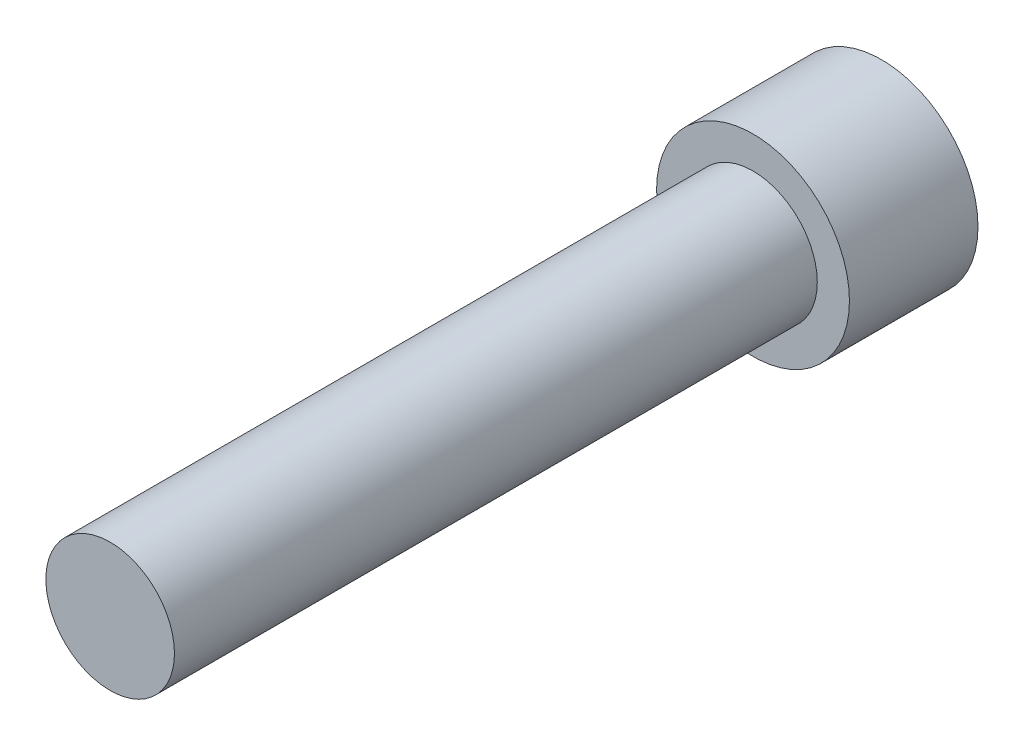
ISO-10303-21;
HEADER;
FILE_DESCRIPTION(('STEP AP214'),'2;1');
FILE_NAME('part.step','',(''),(''),'','','');
FILE_SCHEMA(('AUTOMOTIVE_DESIGN { 1 0 10303 214 1 1 1 1 }'));
ENDSEC;
DATA;
#1=APPLICATION_CONTEXT('core data for automotive mechanical design processes');
#2=APPLICATION_PROTOCOL_DEFINITION('international standard','automotive_design',2000,#1);
#3=PRODUCT_CONTEXT('',#1,'mechanical');
#4=PRODUCT('Part','Part','',(#3));
#5=PRODUCT_RELATED_PRODUCT_CATEGORY('part','',(#4));
#6=PRODUCT_DEFINITION_FORMATION('','',#4);
#7=PRODUCT_DEFINITION_CONTEXT('part definition',#1,'design');
#8=PRODUCT_DEFINITION('design','',#6,#7);
#9=PRODUCT_DEFINITION_SHAPE('','',#8);
#10=(LENGTH_UNIT() NAMED_UNIT(*) SI_UNIT(.MILLI.,.METRE.));
#11=(NAMED_UNIT(*) PLANE_ANGLE_UNIT() SI_UNIT($,.RADIAN.));
#12=(NAMED_UNIT(*) SI_UNIT($,.STERADIAN.) SOLID_ANGLE_UNIT());
#13=UNCERTAINTY_MEASURE_WITH_UNIT(LENGTH_MEASURE(1.E-05),#10,'distance_accuracy_value','');
#14=(GEOMETRIC_REPRESENTATION_CONTEXT(3) GLOBAL_UNCERTAINTY_ASSIGNED_CONTEXT((#13)) GLOBAL_UNIT_ASSIGNED_CONTEXT((#10,
#11,#12)) REPRESENTATION_CONTEXT('',''));
#15=CARTESIAN_POINT('',(0.,0.,0.));
#16=DIRECTION('',(0.,0.,1.));
#17=DIRECTION('',(1.,0.,0.));
#18=AXIS2_PLACEMENT_3D('',#15,#16,#17);
#19=CARTESIAN_POINT('',(0.,-4.7625,-6.35));
#20=DIRECTION('',(0.,0.,-1.));
#21=DIRECTION('',(-1.,0.,0.));
#22=AXIS2_PLACEMENT_3D('',#19,#20,#21);
#23=PLANE('',#22);
#24=DIRECTION('',(0.866025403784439,-0.5,0.));
#25=VECTOR('',#24,1.);
#26=CARTESIAN_POINT('',(0.,2.7569630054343,-6.35));
#27=LINE('',#26,#25);
#28=CARTESIAN_POINT('',(0.,2.7569630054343,-6.35));
#29=VERTEX_POINT('',#28);
#30=CARTESIAN_POINT('',(2.3876,1.37848150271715,-6.35));
#31=VERTEX_POINT('',#30);
#32=EDGE_CURVE('E51',#29,#31,#27,.T.);
#33=ORIENTED_EDGE('',*,*,#32,.F.);
#34=DIRECTION('',(0.866025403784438,0.5,0.));
#35=VECTOR('',#34,1.);
#36=CARTESIAN_POINT('',(-2.3876,1.37848150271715,-6.35));
#37=LINE('',#36,#35);
#38=CARTESIAN_POINT('',(-2.3876,1.37848150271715,-6.35));
#39=VERTEX_POINT('',#38);
#40=EDGE_CURVE('E134',#39,#29,#37,.T.);
#41=ORIENTED_EDGE('',*,*,#40,.F.);
#42=DIRECTION('',(0.,1.,0.));
#43=VECTOR('',#42,1.);
#44=CARTESIAN_POINT('',(-2.3876,-1.37848150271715,-6.35));
#45=LINE('',#44,#43);
#46=CARTESIAN_POINT('',(-2.3876,-1.37848150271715,-6.35));
#47=VERTEX_POINT('',#46);
#48=EDGE_CURVE('E132',#47,#39,#45,.T.);
#49=ORIENTED_EDGE('',*,*,#48,.F.);
#50=DIRECTION('',(-0.866025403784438,0.5,0.));
#51=VECTOR('',#50,1.);
#52=CARTESIAN_POINT('',(0.,-2.7569630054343,-6.35));
#53=LINE('',#52,#51);
#54=CARTESIAN_POINT('',(0.,-2.7569630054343,-6.35));
#55=VERTEX_POINT('',#54);
#56=EDGE_CURVE('E99',#55,#47,#53,.T.);
#57=ORIENTED_EDGE('',*,*,#56,.F.);
#58=DIRECTION('',(-0.866025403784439,-0.5,0.));
#59=VECTOR('',#58,1.);
#60=CARTESIAN_POINT('',(2.3876,-1.37848150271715,-6.35));
#61=LINE('',#60,#59);
#62=CARTESIAN_POINT('',(2.3876,-1.37848150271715,-6.35));
#63=VERTEX_POINT('',#62);
#64=EDGE_CURVE('E128',#63,#55,#61,.T.);
#65=ORIENTED_EDGE('',*,*,#64,.F.);
#66=DIRECTION('',(0.,-1.,0.));
#67=VECTOR('',#66,1.);
#68=CARTESIAN_POINT('',(2.3876,1.37848150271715,-6.35));
#69=LINE('',#68,#67);
#70=EDGE_CURVE('E125',#31,#63,#69,.T.);
#71=ORIENTED_EDGE('',*,*,#70,.F.);
#72=EDGE_LOOP('',(#33,#41,#49,#57,#65,#71));
#73=FACE_BOUND('',#72,.T.);
#74=CARTESIAN_POINT('',(0.,0.,-6.35));
#75=DIRECTION('',(0.,0.,1.));
#76=DIRECTION('',(1.,0.,0.));
#77=AXIS2_PLACEMENT_3D('',#74,#75,#76);
#78=CIRCLE('',#77,4.7625);
#79=CARTESIAN_POINT('',(4.7625,0.,-6.35));
#80=VERTEX_POINT('',#79);
#81=EDGE_CURVE('E11',#80,#80,#78,.T.);
#82=ORIENTED_EDGE('',*,*,#81,.F.);
#83=EDGE_LOOP('',(#82));
#84=FACE_BOUND('',#83,.T.);
#85=ADVANCED_FACE('F37',(#73,#84),#23,.T.);
#86=CARTESIAN_POINT('',(0.,0.,31.75));
#87=DIRECTION('',(0.,0.,1.));
#88=DIRECTION('',(1.,0.,0.));
#89=AXIS2_PLACEMENT_3D('',#86,#87,#88);
#90=CYLINDRICAL_SURFACE('',#89,4.7625);
#91=ORIENTED_EDGE('',*,*,#81,.T.);
#92=EDGE_LOOP('',(#91));
#93=FACE_BOUND('',#92,.T.);
#94=CARTESIAN_POINT('',(0.,0.,0.));
#95=DIRECTION('',(0.,0.,1.));
#96=DIRECTION('',(1.,0.,0.));
#97=AXIS2_PLACEMENT_3D('',#94,#95,#96);
#98=CIRCLE('',#97,4.7625);
#99=CARTESIAN_POINT('',(4.7625,0.,0.));
#100=VERTEX_POINT('',#99);
#101=EDGE_CURVE('E44',#100,#100,#98,.T.);
#102=ORIENTED_EDGE('',*,*,#101,.F.);
#103=EDGE_LOOP('',(#102));
#104=FACE_BOUND('',#103,.T.);
#105=ADVANCED_FACE('F154',(#93,#104),#90,.T.);
#106=CARTESIAN_POINT('',(0.,-3.175,0.));
#107=DIRECTION('',(0.,0.,1.));
#108=DIRECTION('',(1.,0.,0.));
#109=AXIS2_PLACEMENT_3D('',#106,#107,#108);
#110=PLANE('',#109);
#111=ORIENTED_EDGE('',*,*,#101,.T.);
#112=EDGE_LOOP('',(#111));
#113=FACE_BOUND('',#112,.T.);
#114=CARTESIAN_POINT('',(0.,0.,0.));
#115=DIRECTION('',(0.,0.,1.));
#116=DIRECTION('',(1.,0.,0.));
#117=AXIS2_PLACEMENT_3D('',#114,#115,#116);
#118=CIRCLE('',#117,3.175);
#119=CARTESIAN_POINT('',(3.175,0.,0.));
#120=VERTEX_POINT('',#119);
#121=EDGE_CURVE('E146',#120,#120,#118,.T.);
#122=ORIENTED_EDGE('',*,*,#121,.F.);
#123=EDGE_LOOP('',(#122));
#124=FACE_BOUND('',#123,.T.);
#125=ADVANCED_FACE('F151',(#113,#124),#110,.T.);
#126=CARTESIAN_POINT('',(0.,0.,31.75));
#127=DIRECTION('',(0.,0.,1.));
#128=DIRECTION('',(1.,0.,0.));
#129=AXIS2_PLACEMENT_3D('',#126,#127,#128);
#130=CYLINDRICAL_SURFACE('',#129,3.175);
#131=ORIENTED_EDGE('',*,*,#121,.T.);
#132=EDGE_LOOP('',(#131));
#133=FACE_BOUND('',#132,.T.);
#134=CARTESIAN_POINT('',(0.,0.,31.75));
#135=DIRECTION('',(0.,0.,1.));
#136=DIRECTION('',(1.,0.,0.));
#137=AXIS2_PLACEMENT_3D('',#134,#135,#136);
#138=CIRCLE('',#137,3.175);
#139=CARTESIAN_POINT('',(3.175,0.,31.75));
#140=VERTEX_POINT('',#139);
#141=EDGE_CURVE('E138',#140,#140,#138,.T.);
#142=ORIENTED_EDGE('',*,*,#141,.F.);
#143=EDGE_LOOP('',(#142));
#144=FACE_BOUND('',#143,.T.);
#145=ADVANCED_FACE('F161',(#133,#144),#130,.T.);
#146=CARTESIAN_POINT('',(0.,0.,31.75));
#147=DIRECTION('',(0.,0.,1.));
#148=DIRECTION('',(1.,0.,0.));
#149=AXIS2_PLACEMENT_3D('',#146,#147,#148);
#150=PLANE('',#149);
#151=ORIENTED_EDGE('',*,*,#141,.T.);
#152=EDGE_LOOP('',(#151));
#153=FACE_BOUND('',#152,.T.);
#154=ADVANCED_FACE('F167',(#153),#150,.T.);
#155=CARTESIAN_POINT('',(0.,2.7569630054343,-2.794));
#156=DIRECTION('',(0.5,0.866025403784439,0.));
#157=DIRECTION('',(-0.866025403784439,0.5,0.));
#158=AXIS2_PLACEMENT_3D('',#155,#156,#157);
#159=PLANE('',#158);
#160=ORIENTED_EDGE('',*,*,#32,.T.);
#161=DIRECTION('',(0.,0.,-1.));
#162=VECTOR('',#161,1.);
#163=CARTESIAN_POINT('',(2.3876,1.37848150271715,-2.794));
#164=LINE('',#163,#162);
#165=CARTESIAN_POINT('',(2.3876,1.37848150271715,-2.794));
#166=VERTEX_POINT('',#165);
#167=EDGE_CURVE('E81',#166,#31,#164,.T.);
#168=ORIENTED_EDGE('',*,*,#167,.F.);
#169=DIRECTION('',(0.866025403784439,-0.5,0.));
#170=VECTOR('',#169,1.);
#171=CARTESIAN_POINT('',(0.,2.7569630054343,-2.794));
#172=LINE('',#171,#170);
#173=CARTESIAN_POINT('',(0.,2.7569630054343,-2.794));
#174=VERTEX_POINT('',#173);
#175=EDGE_CURVE('E136',#174,#166,#172,.T.);
#176=ORIENTED_EDGE('',*,*,#175,.F.);
#177=DIRECTION('',(0.,0.,-1.));
#178=VECTOR('',#177,1.);
#179=CARTESIAN_POINT('',(0.,2.7569630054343,-2.794));
#180=LINE('',#179,#178);
#181=EDGE_CURVE('E59',#174,#29,#180,.T.);
#182=ORIENTED_EDGE('',*,*,#181,.T.);
#183=EDGE_LOOP('',(#160,#168,#176,#182));
#184=FACE_BOUND('',#183,.T.);
#185=ADVANCED_FACE('F171',(#184),#159,.F.);
#186=CARTESIAN_POINT('',(-2.3876,1.37848150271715,-2.794));
#187=DIRECTION('',(-0.5,0.866025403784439,0.));
#188=DIRECTION('',(-0.866025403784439,-0.5,0.));
#189=AXIS2_PLACEMENT_3D('',#186,#187,#188);
#190=PLANE('',#189);
#191=ORIENTED_EDGE('',*,*,#40,.T.);
#192=ORIENTED_EDGE('',*,*,#181,.F.);
#193=DIRECTION('',(0.866025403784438,0.5,0.));
#194=VECTOR('',#193,1.);
#195=CARTESIAN_POINT('',(-2.3876,1.37848150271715,-2.794));
#196=LINE('',#195,#194);
#197=CARTESIAN_POINT('',(-2.3876,1.37848150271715,-2.794));
#198=VERTEX_POINT('',#197);
#199=EDGE_CURVE('E111',#198,#174,#196,.T.);
#200=ORIENTED_EDGE('',*,*,#199,.F.);
#201=DIRECTION('',(0.,0.,-1.));
#202=VECTOR('',#201,1.);
#203=CARTESIAN_POINT('',(-2.3876,1.37848150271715,-2.794));
#204=LINE('',#203,#202);
#205=EDGE_CURVE('E103',#198,#39,#204,.T.);
#206=ORIENTED_EDGE('',*,*,#205,.T.);
#207=EDGE_LOOP('',(#191,#192,#200,#206));
#208=FACE_BOUND('',#207,.T.);
#209=ADVANCED_FACE('F175',(#208),#190,.F.);
#210=CARTESIAN_POINT('',(-2.3876,-1.37848150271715,-2.794));
#211=DIRECTION('',(-1.,0.,0.));
#212=DIRECTION('',(0.,0.,1.));
#213=AXIS2_PLACEMENT_3D('',#210,#211,#212);
#214=PLANE('',#213);
#215=ORIENTED_EDGE('',*,*,#48,.T.);
#216=ORIENTED_EDGE('',*,*,#205,.F.);
#217=DIRECTION('',(0.,1.,0.));
#218=VECTOR('',#217,1.);
#219=CARTESIAN_POINT('',(-2.3876,-1.37848150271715,-2.794));
#220=LINE('',#219,#218);
#221=CARTESIAN_POINT('',(-2.3876,-1.37848150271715,-2.794));
#222=VERTEX_POINT('',#221);
#223=EDGE_CURVE('E107',#222,#198,#220,.T.);
#224=ORIENTED_EDGE('',*,*,#223,.F.);
#225=DIRECTION('',(0.,0.,-1.));
#226=VECTOR('',#225,1.);
#227=CARTESIAN_POINT('',(-2.3876,-1.37848150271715,-2.794));
#228=LINE('',#227,#226);
#229=EDGE_CURVE('E92',#222,#47,#228,.T.);
#230=ORIENTED_EDGE('',*,*,#229,.T.);
#231=EDGE_LOOP('',(#215,#216,#224,#230));
#232=FACE_BOUND('',#231,.T.);
#233=ADVANCED_FACE('F108',(#232),#214,.F.);
#234=CARTESIAN_POINT('',(0.,-2.7569630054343,-2.794));
#235=DIRECTION('',(-0.5,-0.866025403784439,0.));
#236=DIRECTION('',(0.866025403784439,-0.5,0.));
#237=AXIS2_PLACEMENT_3D('',#234,#235,#236);
#238=PLANE('',#237);
#239=ORIENTED_EDGE('',*,*,#56,.T.);
#240=ORIENTED_EDGE('',*,*,#229,.F.);
#241=DIRECTION('',(-0.866025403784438,0.5,0.));
#242=VECTOR('',#241,1.);
#243=CARTESIAN_POINT('',(0.,-2.7569630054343,-2.794));
#244=LINE('',#243,#242);
#245=CARTESIAN_POINT('',(0.,-2.7569630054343,-2.794));
#246=VERTEX_POINT('',#245);
#247=EDGE_CURVE('E96',#246,#222,#244,.T.);
#248=ORIENTED_EDGE('',*,*,#247,.F.);
#249=DIRECTION('',(0.,0.,-1.));
#250=VECTOR('',#249,1.);
#251=CARTESIAN_POINT('',(0.,-2.7569630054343,-2.794));
#252=LINE('',#251,#250);
#253=EDGE_CURVE('E104',#246,#55,#252,.T.);
#254=ORIENTED_EDGE('',*,*,#253,.T.);
#255=EDGE_LOOP('',(#239,#240,#248,#254));
#256=FACE_BOUND('',#255,.T.);
#257=ADVANCED_FACE('F94',(#256),#238,.F.);
#258=CARTESIAN_POINT('',(2.3876,-1.37848150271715,-2.794));
#259=DIRECTION('',(0.5,-0.866025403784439,0.));
#260=DIRECTION('',(0.866025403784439,0.5,0.));
#261=AXIS2_PLACEMENT_3D('',#258,#259,#260);
#262=PLANE('',#261);
#263=ORIENTED_EDGE('',*,*,#64,.T.);
#264=ORIENTED_EDGE('',*,*,#253,.F.);
#265=DIRECTION('',(-0.866025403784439,-0.5,0.));
#266=VECTOR('',#265,1.);
#267=CARTESIAN_POINT('',(2.3876,-1.37848150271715,-2.794));
#268=LINE('',#267,#266);
#269=CARTESIAN_POINT('',(2.3876,-1.37848150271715,-2.794));
#270=VERTEX_POINT('',#269);
#271=EDGE_CURVE('E117',#270,#246,#268,.T.);
#272=ORIENTED_EDGE('',*,*,#271,.F.);
#273=DIRECTION('',(0.,0.,-1.));
#274=VECTOR('',#273,1.);
#275=CARTESIAN_POINT('',(2.3876,-1.37848150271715,-2.794));
#276=LINE('',#275,#274);
#277=EDGE_CURVE('E141',#270,#63,#276,.T.);
#278=ORIENTED_EDGE('',*,*,#277,.T.);
#279=EDGE_LOOP('',(#263,#264,#272,#278));
#280=FACE_BOUND('',#279,.T.);
#281=ADVANCED_FACE('F179',(#280),#262,.F.);
#282=CARTESIAN_POINT('',(2.3876,1.37848150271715,-2.794));
#283=DIRECTION('',(1.,0.,0.));
#284=DIRECTION('',(0.,0.,-1.));
#285=AXIS2_PLACEMENT_3D('',#282,#283,#284);
#286=PLANE('',#285);
#287=ORIENTED_EDGE('',*,*,#70,.T.);
#288=ORIENTED_EDGE('',*,*,#277,.F.);
#289=DIRECTION('',(0.,-1.,0.));
#290=VECTOR('',#289,1.);
#291=CARTESIAN_POINT('',(2.3876,1.37848150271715,-2.794));
#292=LINE('',#291,#290);
#293=EDGE_CURVE('E119',#166,#270,#292,.T.);
#294=ORIENTED_EDGE('',*,*,#293,.F.);
#295=ORIENTED_EDGE('',*,*,#167,.T.);
#296=EDGE_LOOP('',(#287,#288,#294,#295));
#297=FACE_BOUND('',#296,.T.);
#298=ADVANCED_FACE('F176',(#297),#286,.F.);
#299=CARTESIAN_POINT('',(0.,2.7569630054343,-2.794));
#300=DIRECTION('',(0.,0.,1.));
#301=DIRECTION('',(1.,0.,0.));
#302=AXIS2_PLACEMENT_3D('',#299,#300,#301);
#303=PLANE('',#302);
#304=ORIENTED_EDGE('',*,*,#175,.T.);
#305=ORIENTED_EDGE('',*,*,#293,.T.);
#306=ORIENTED_EDGE('',*,*,#271,.T.);
#307=ORIENTED_EDGE('',*,*,#247,.T.);
#308=ORIENTED_EDGE('',*,*,#223,.T.);
#309=ORIENTED_EDGE('',*,*,#199,.T.);
#310=EDGE_LOOP('',(#304,#305,#306,#307,#308,#309));
#311=FACE_BOUND('',#310,.T.);
#312=ADVANCED_FACE('F114',(#311),#303,.F.);
#313=CLOSED_SHELL('',(#85,#105,#125,#145,#154,#185,#209,#233,#257,#281,#298,#312));
#314=MANIFOLD_SOLID_BREP('B2',#313);
#315=ADVANCED_BREP_SHAPE_REPRESENTATION('',(#18,#314),#14);
#316=SHAPE_DEFINITION_REPRESENTATION(#9,#315);
ENDSEC;
END-ISO-10303-21;
